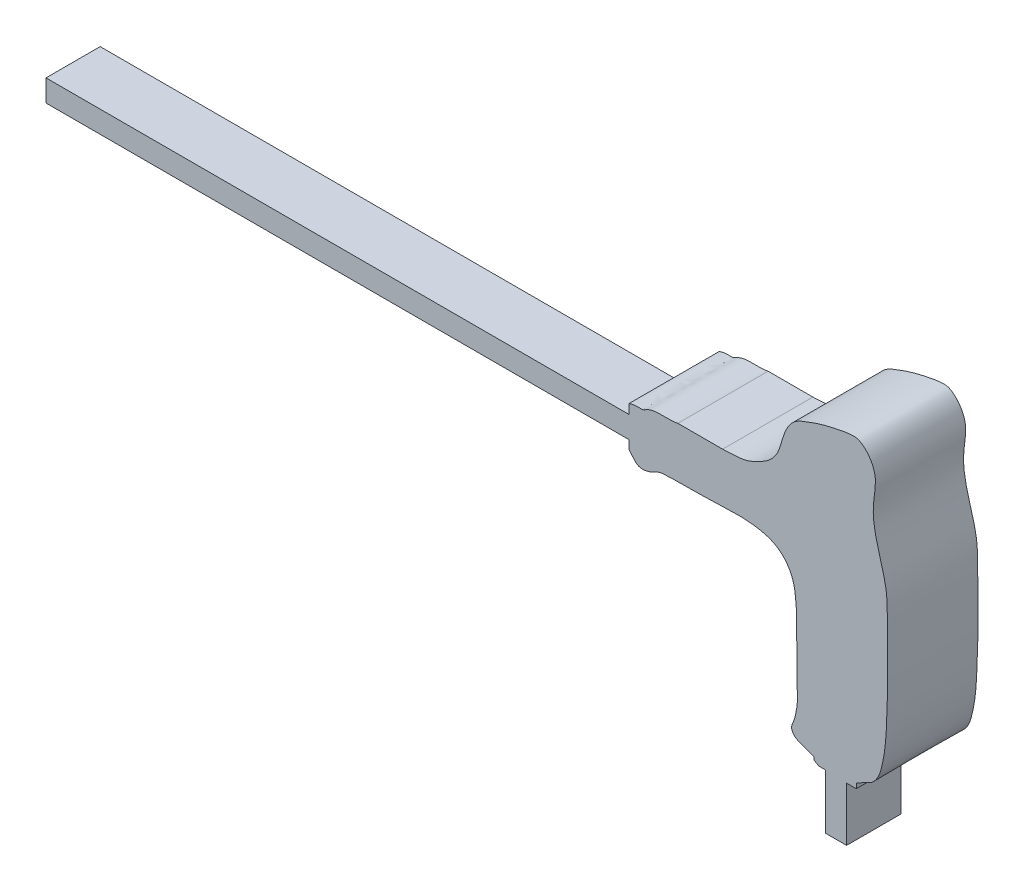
ISO-10303-21;
HEADER;
FILE_DESCRIPTION(('STEP AP214'),'2;1');
FILE_NAME('part.step','',(''),(''),'','','');
FILE_SCHEMA(('AUTOMOTIVE_DESIGN { 1 0 10303 214 1 1 1 1 }'));
ENDSEC;
DATA;
#1=APPLICATION_CONTEXT('core data for automotive mechanical design processes');
#2=APPLICATION_PROTOCOL_DEFINITION('international standard','automotive_design',2000,#1);
#3=PRODUCT_CONTEXT('',#1,'mechanical');
#4=PRODUCT('Part','Part','',(#3));
#5=PRODUCT_RELATED_PRODUCT_CATEGORY('part','',(#4));
#6=PRODUCT_DEFINITION_FORMATION('','',#4);
#7=PRODUCT_DEFINITION_CONTEXT('part definition',#1,'design');
#8=PRODUCT_DEFINITION('design','',#6,#7);
#9=PRODUCT_DEFINITION_SHAPE('','',#8);
#10=(LENGTH_UNIT() NAMED_UNIT(*) SI_UNIT(.MILLI.,.METRE.));
#11=(NAMED_UNIT(*) PLANE_ANGLE_UNIT() SI_UNIT($,.RADIAN.));
#12=(NAMED_UNIT(*) SI_UNIT($,.STERADIAN.) SOLID_ANGLE_UNIT());
#13=UNCERTAINTY_MEASURE_WITH_UNIT(LENGTH_MEASURE(1.E-05),#10,'distance_accuracy_value','');
#14=(GEOMETRIC_REPRESENTATION_CONTEXT(3) GLOBAL_UNCERTAINTY_ASSIGNED_CONTEXT((#13)) GLOBAL_UNIT_ASSIGNED_CONTEXT((#10,
#11,#12)) REPRESENTATION_CONTEXT('',''));
#15=CARTESIAN_POINT('',(0.,0.,0.));
#16=DIRECTION('',(0.,0.,1.));
#17=DIRECTION('',(1.,0.,0.));
#18=AXIS2_PLACEMENT_3D('',#15,#16,#17);
#19=CARTESIAN_POINT('',(248.543123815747,68.8810785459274,-10.));
#20=DIRECTION('',(1.,0.,0.));
#21=DIRECTION('',(0.,0.,-1.));
#22=AXIS2_PLACEMENT_3D('',#19,#20,#21);
#23=PLANE('',#22);
#24=DIRECTION('',(0.,0.,1.));
#25=VECTOR('',#24,1.);
#26=CARTESIAN_POINT('',(248.543123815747,68.8810785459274,-10.));
#27=LINE('',#26,#25);
#28=CARTESIAN_POINT('',(248.543123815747,68.8810785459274,-2.));
#29=VERTEX_POINT('',#28);
#30=CARTESIAN_POINT('',(248.543123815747,68.8810785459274,10.));
#31=VERTEX_POINT('',#30);
#32=EDGE_CURVE('E387',#29,#31,#27,.T.);
#33=ORIENTED_EDGE('',*,*,#32,.F.);
#34=DIRECTION('',(0.,-1.,0.));
#35=VECTOR('',#34,1.);
#36=CARTESIAN_POINT('',(248.543123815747,68.8810785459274,-2.));
#37=LINE('',#36,#35);
#38=CARTESIAN_POINT('',(248.543123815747,80.8323200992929,-2.));
#39=VERTEX_POINT('',#38);
#40=EDGE_CURVE('E183',#39,#29,#37,.T.);
#41=ORIENTED_EDGE('',*,*,#40,.F.);
#42=DIRECTION('',(0.,0.,1.));
#43=VECTOR('',#42,1.);
#44=CARTESIAN_POINT('',(248.543123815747,80.8323200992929,-10.));
#45=LINE('',#44,#43);
#46=CARTESIAN_POINT('',(248.543123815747,80.8323200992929,10.));
#47=VERTEX_POINT('',#46);
#48=EDGE_CURVE('E179',#39,#47,#45,.T.);
#49=ORIENTED_EDGE('',*,*,#48,.T.);
#50=DIRECTION('',(0.,1.,0.));
#51=VECTOR('',#50,1.);
#52=CARTESIAN_POINT('',(248.543123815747,68.8810785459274,10.));
#53=LINE('',#52,#51);
#54=EDGE_CURVE('E264',#31,#47,#53,.T.);
#55=ORIENTED_EDGE('',*,*,#54,.F.);
#56=EDGE_LOOP('',(#33,#41,#49,#55));
#57=FACE_BOUND('',#56,.T.);
#58=ADVANCED_FACE('F39',(#57),#23,.T.);
#59=CARTESIAN_POINT('',(243.892148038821,68.8810785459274,-10.));
#60=DIRECTION('',(0.,-1.,0.));
#61=DIRECTION('',(0.,0.,-1.));
#62=AXIS2_PLACEMENT_3D('',#59,#60,#61);
#63=PLANE('',#62);
#64=DIRECTION('',(0.,0.,1.));
#65=VECTOR('',#64,1.);
#66=CARTESIAN_POINT('',(243.892148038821,68.8810785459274,-10.));
#67=LINE('',#66,#65);
#68=CARTESIAN_POINT('',(243.892148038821,68.8810785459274,-2.));
#69=VERTEX_POINT('',#68);
#70=CARTESIAN_POINT('',(243.892148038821,68.8810785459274,10.));
#71=VERTEX_POINT('',#70);
#72=EDGE_CURVE('E384',#69,#71,#67,.T.);
#73=ORIENTED_EDGE('',*,*,#72,.F.);
#74=DIRECTION('',(-1.,0.,0.));
#75=VECTOR('',#74,1.);
#76=CARTESIAN_POINT('',(243.892148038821,68.8810785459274,-2.));
#77=LINE('',#76,#75);
#78=EDGE_CURVE('E189',#29,#69,#77,.T.);
#79=ORIENTED_EDGE('',*,*,#78,.F.);
#80=ORIENTED_EDGE('',*,*,#32,.T.);
#81=DIRECTION('',(1.,0.,0.));
#82=VECTOR('',#81,1.);
#83=CARTESIAN_POINT('',(243.892148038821,68.8810785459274,10.));
#84=LINE('',#83,#82);
#85=EDGE_CURVE('E260',#71,#31,#84,.T.);
#86=ORIENTED_EDGE('',*,*,#85,.F.);
#87=EDGE_LOOP('',(#73,#79,#80,#86));
#88=FACE_BOUND('',#87,.T.);
#89=ADVANCED_FACE('F341',(#88),#63,.T.);
#90=CARTESIAN_POINT('',(211.155897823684,131.182219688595,-10.));
#91=CARTESIAN_POINT('',(208.979704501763,130.678712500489,-10.));
#92=CARTESIAN_POINT('',(205.927795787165,131.591395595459,-10.));
#93=CARTESIAN_POINT('',(203.484426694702,129.856707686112,-10.));
#94=CARTESIAN_POINT('',(202.113381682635,129.945278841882,-10.));
#95=CARTESIAN_POINT('',(201.11870916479,129.844045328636,-10.));
#96=CARTESIAN_POINT('',(200.32685086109,129.565005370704,-10.));
#97=B_SPLINE_CURVE_WITH_KNOTS('',3,(#90,#91,#92,#93,#94,#95,#96),.UNSPECIFIED.,.F.,.F.,(4,1,1,1,
4),(0.,0.636596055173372,0.720634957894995,0.778990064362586,1.),.UNSPECIFIED.);
#98=DIRECTION('',(0.,0.,1.));
#99=VECTOR('',#98,1.);
#100=SURFACE_OF_LINEAR_EXTRUSION('',#97,#99);
#101=DIRECTION('',(0.,0.,1.));
#102=VECTOR('',#101,1.);
#103=CARTESIAN_POINT('',(200.32685086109,129.565005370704,-10.));
#104=LINE('',#103,#102);
#105=CARTESIAN_POINT('',(200.32685086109,129.565005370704,-10.));
#106=VERTEX_POINT('',#105);
#107=CARTESIAN_POINT('',(200.32685086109,129.565005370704,10.));
#108=VERTEX_POINT('',#107);
#109=EDGE_CURVE('E11',#106,#108,#104,.T.);
#110=ORIENTED_EDGE('',*,*,#109,.T.);
#111=CARTESIAN_POINT('',(211.155897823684,131.182219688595,10.));
#112=CARTESIAN_POINT('',(208.979704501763,130.678712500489,10.));
#113=CARTESIAN_POINT('',(205.927795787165,131.591395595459,10.));
#114=CARTESIAN_POINT('',(203.484426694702,129.856707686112,10.));
#115=CARTESIAN_POINT('',(202.113381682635,129.945278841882,10.));
#116=CARTESIAN_POINT('',(201.11870916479,129.844045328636,10.));
#117=CARTESIAN_POINT('',(200.32685086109,129.565005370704,10.));
#118=B_SPLINE_CURVE_WITH_KNOTS('',3,(#111,#112,#113,#114,#115,#116,#117),.UNSPECIFIED.,.F.,.F.,
(4,1,1,1,4),(0.,0.636596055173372,0.720634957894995,0.778990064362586,1.),.UNSPECIFIED.);
#119=CARTESIAN_POINT('',(211.155897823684,131.182219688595,10.));
#120=VERTEX_POINT('',#119);
#121=EDGE_CURVE('E293',#120,#108,#118,.T.);
#122=ORIENTED_EDGE('',*,*,#121,.F.);
#123=DIRECTION('',(0.,0.,1.));
#124=VECTOR('',#123,1.);
#125=CARTESIAN_POINT('',(211.155897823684,131.182219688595,-10.));
#126=LINE('',#125,#124);
#127=CARTESIAN_POINT('',(211.155897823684,131.182219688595,-10.));
#128=VERTEX_POINT('',#127);
#129=EDGE_CURVE('E49',#128,#120,#126,.T.);
#130=ORIENTED_EDGE('',*,*,#129,.F.);
#131=EDGE_CURVE('E410',#128,#106,#97,.T.);
#132=ORIENTED_EDGE('',*,*,#131,.T.);
#133=EDGE_LOOP('',(#110,#122,#130,#132));
#134=FACE_BOUND('',#133,.T.);
#135=ADVANCED_FACE('F347',(#134),#100,.T.);
#136=CARTESIAN_POINT('',(221.073684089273,131.182219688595,-10.));
#137=DIRECTION('',(0.,1.,0.));
#138=DIRECTION('',(0.,0.,1.));
#139=AXIS2_PLACEMENT_3D('',#136,#137,#138);
#140=PLANE('',#139);
#141=ORIENTED_EDGE('',*,*,#129,.T.);
#142=DIRECTION('',(-1.,0.,0.));
#143=VECTOR('',#142,1.);
#144=CARTESIAN_POINT('',(221.073684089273,131.182219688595,10.));
#145=LINE('',#144,#143);
#146=CARTESIAN_POINT('',(221.073684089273,131.182219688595,10.));
#147=VERTEX_POINT('',#146);
#148=EDGE_CURVE('E286',#147,#120,#145,.T.);
#149=ORIENTED_EDGE('',*,*,#148,.F.);
#150=DIRECTION('',(0.,0.,1.));
#151=VECTOR('',#150,1.);
#152=CARTESIAN_POINT('',(221.073684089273,131.182219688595,-10.));
#153=LINE('',#152,#151);
#154=CARTESIAN_POINT('',(221.073684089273,131.182219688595,-10.));
#155=VERTEX_POINT('',#154);
#156=EDGE_CURVE('E484',#155,#147,#153,.T.);
#157=ORIENTED_EDGE('',*,*,#156,.F.);
#158=DIRECTION('',(-1.,0.,0.));
#159=VECTOR('',#158,1.);
#160=CARTESIAN_POINT('',(221.073684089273,131.182219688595,-10.));
#161=LINE('',#160,#159);
#162=EDGE_CURVE('E414',#155,#128,#161,.T.);
#163=ORIENTED_EDGE('',*,*,#162,.T.);
#164=EDGE_LOOP('',(#141,#149,#157,#163));
#165=FACE_BOUND('',#164,.T.);
#166=ADVANCED_FACE('F434',(#165),#140,.T.);
#167=CARTESIAN_POINT('',(253.959450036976,83.6582294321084,-10.));
#168=CARTESIAN_POINT('',(255.413681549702,84.6922926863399,-10.));
#169=CARTESIAN_POINT('',(256.309889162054,87.3981421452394,-10.));
#170=CARTESIAN_POINT('',(257.160439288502,92.0414444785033,-10.));
#171=CARTESIAN_POINT('',(257.489936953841,97.8069514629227,-10.));
#172=CARTESIAN_POINT('',(257.740569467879,106.695670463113,-10.));
#173=CARTESIAN_POINT('',(257.629973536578,115.016264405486,-10.));
#174=CARTESIAN_POINT('',(257.507672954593,121.95001484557,-10.));
#175=CARTESIAN_POINT('',(256.412860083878,126.329435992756,-10.));
#176=CARTESIAN_POINT('',(255.268117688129,130.057147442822,-10.));
#177=CARTESIAN_POINT('',(254.587312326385,133.489662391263,-10.));
#178=CARTESIAN_POINT('',(254.291883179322,136.786594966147,-10.));
#179=CARTESIAN_POINT('',(254.855353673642,139.753661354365,-10.));
#180=CARTESIAN_POINT('',(254.96417065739,142.332617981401,-10.));
#181=CARTESIAN_POINT('',(254.602684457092,144.386360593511,-10.));
#182=CARTESIAN_POINT('',(253.368907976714,146.515906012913,-10.));
#183=CARTESIAN_POINT('',(251.312767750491,148.275219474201,-10.));
#184=CARTESIAN_POINT('',(249.073245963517,148.206115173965,-10.));
#185=CARTESIAN_POINT('',(246.675452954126,147.760865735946,-10.));
#186=CARTESIAN_POINT('',(243.29854346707,147.029921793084,-10.));
#187=CARTESIAN_POINT('',(239.860743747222,145.872385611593,-10.));
#188=CARTESIAN_POINT('',(236.767514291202,144.537003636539,-10.));
#189=CARTESIAN_POINT('',(235.06492199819,142.087752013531,-10.));
#190=CARTESIAN_POINT('',(234.190435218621,139.400971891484,-10.));
#191=CARTESIAN_POINT('',(233.410607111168,136.496224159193,-10.));
#192=CARTESIAN_POINT('',(231.543851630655,134.134279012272,-10.));
#193=CARTESIAN_POINT('',(229.032596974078,132.759340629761,-10.));
#194=CARTESIAN_POINT('',(225.671749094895,131.137093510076,-10.));
#195=CARTESIAN_POINT('',(222.852034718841,131.354890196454,-10.));
#196=CARTESIAN_POINT('',(221.073684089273,131.182219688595,-10.));
#197=B_SPLINE_CURVE_WITH_KNOTS('',3,(#167,#168,#169,#170,#171,#172,#173,#174,#175,#176,#177,
#178,#179,#180,#181,#182,#183,#184,#185,#186,#187,#188,#189,#190,#191,#192,#193,#194,#195,#196),
.UNSPECIFIED.,.F.,.F.,(4,1,1,1,1,1,1,1,1,1,1,1,1,1,1,1,1,1,1,1,1,1,1,1,1,1,1,4),(0.,
0.0484624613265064,0.0788890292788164,0.136163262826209,0.213713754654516,0.334449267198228,
0.375532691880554,0.412085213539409,0.463525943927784,0.487574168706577,0.512536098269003,
0.558031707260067,0.573645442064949,0.586449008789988,0.617324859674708,0.643355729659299,
0.658312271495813,0.67960839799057,0.713953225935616,0.756990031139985,0.784651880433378,
0.808074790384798,0.839786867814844,0.865879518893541,0.893817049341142,0.923166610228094,
0.947560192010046,1.),.UNSPECIFIED.);
#198=DIRECTION('',(0.,0.,1.));
#199=VECTOR('',#198,1.);
#200=SURFACE_OF_LINEAR_EXTRUSION('',#197,#199);
#201=ORIENTED_EDGE('',*,*,#156,.T.);
#202=CARTESIAN_POINT('',(253.959450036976,83.6582294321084,10.));
#203=CARTESIAN_POINT('',(255.413681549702,84.6922926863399,10.));
#204=CARTESIAN_POINT('',(256.309889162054,87.3981421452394,10.));
#205=CARTESIAN_POINT('',(257.160439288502,92.0414444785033,10.));
#206=CARTESIAN_POINT('',(257.489936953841,97.8069514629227,10.));
#207=CARTESIAN_POINT('',(257.740569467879,106.695670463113,10.));
#208=CARTESIAN_POINT('',(257.629973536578,115.016264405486,10.));
#209=CARTESIAN_POINT('',(257.507672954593,121.95001484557,10.));
#210=CARTESIAN_POINT('',(256.412860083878,126.329435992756,10.));
#211=CARTESIAN_POINT('',(255.268117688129,130.057147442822,10.));
#212=CARTESIAN_POINT('',(254.587312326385,133.489662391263,10.));
#213=CARTESIAN_POINT('',(254.291883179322,136.786594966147,10.));
#214=CARTESIAN_POINT('',(254.855353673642,139.753661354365,10.));
#215=CARTESIAN_POINT('',(254.96417065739,142.332617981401,10.));
#216=CARTESIAN_POINT('',(254.602684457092,144.386360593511,10.));
#217=CARTESIAN_POINT('',(253.368907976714,146.515906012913,10.));
#218=CARTESIAN_POINT('',(251.312767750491,148.275219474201,10.));
#219=CARTESIAN_POINT('',(249.073245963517,148.206115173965,10.));
#220=CARTESIAN_POINT('',(246.675452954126,147.760865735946,10.));
#221=CARTESIAN_POINT('',(243.29854346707,147.029921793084,10.));
#222=CARTESIAN_POINT('',(239.860743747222,145.872385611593,10.));
#223=CARTESIAN_POINT('',(236.767514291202,144.537003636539,10.));
#224=CARTESIAN_POINT('',(235.06492199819,142.087752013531,10.));
#225=CARTESIAN_POINT('',(234.190435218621,139.400971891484,10.));
#226=CARTESIAN_POINT('',(233.410607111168,136.496224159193,10.));
#227=CARTESIAN_POINT('',(231.543851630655,134.134279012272,10.));
#228=CARTESIAN_POINT('',(229.032596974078,132.759340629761,10.));
#229=CARTESIAN_POINT('',(225.671749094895,131.137093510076,10.));
#230=CARTESIAN_POINT('',(222.852034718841,131.354890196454,10.));
#231=CARTESIAN_POINT('',(221.073684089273,131.182219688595,10.));
#232=B_SPLINE_CURVE_WITH_KNOTS('',3,(#202,#203,#204,#205,#206,#207,#208,#209,#210,#211,#212,
#213,#214,#215,#216,#217,#218,#219,#220,#221,#222,#223,#224,#225,#226,#227,#228,#229,#230,#231),
.UNSPECIFIED.,.F.,.F.,(4,1,1,1,1,1,1,1,1,1,1,1,1,1,1,1,1,1,1,1,1,1,1,1,1,1,1,4),(0.,
0.0484624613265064,0.0788890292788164,0.136163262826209,0.213713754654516,0.334449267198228,
0.375532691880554,0.412085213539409,0.463525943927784,0.487574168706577,0.512536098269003,
0.558031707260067,0.573645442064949,0.586449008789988,0.617324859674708,0.643355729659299,
0.658312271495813,0.67960839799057,0.713953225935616,0.756990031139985,0.784651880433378,
0.808074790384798,0.839786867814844,0.865879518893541,0.893817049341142,0.923166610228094,
0.947560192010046,1.),.UNSPECIFIED.);
#233=CARTESIAN_POINT('',(253.959450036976,83.6582294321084,10.));
#234=VERTEX_POINT('',#233);
#235=EDGE_CURVE('E280',#234,#147,#232,.T.);
#236=ORIENTED_EDGE('',*,*,#235,.F.);
#237=DIRECTION('',(0.,0.,1.));
#238=VECTOR('',#237,1.);
#239=CARTESIAN_POINT('',(253.959450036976,83.6582294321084,-10.));
#240=LINE('',#239,#238);
#241=CARTESIAN_POINT('',(253.959450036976,83.6582294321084,-10.));
#242=VERTEX_POINT('',#241);
#243=EDGE_CURVE('E489',#242,#234,#240,.T.);
#244=ORIENTED_EDGE('',*,*,#243,.F.);
#245=EDGE_CURVE('E420',#242,#155,#197,.T.);
#246=ORIENTED_EDGE('',*,*,#245,.T.);
#247=EDGE_LOOP('',(#201,#236,#244,#246));
#248=FACE_BOUND('',#247,.T.);
#249=ADVANCED_FACE('F438',(#248),#200,.T.);
#250=CARTESIAN_POINT('',(250.691992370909,81.9541921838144,-10.));
#251=DIRECTION('',(0.462411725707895,-0.886665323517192,0.));
#252=DIRECTION('',(0.886665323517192,0.462411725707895,0.));
#253=AXIS2_PLACEMENT_3D('',#250,#251,#252);
#254=PLANE('',#253);
#255=ORIENTED_EDGE('',*,*,#243,.T.);
#256=DIRECTION('',(0.886665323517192,0.462411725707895,0.));
#257=VECTOR('',#256,1.);
#258=CARTESIAN_POINT('',(250.691992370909,81.9541921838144,10.));
#259=LINE('',#258,#257);
#260=CARTESIAN_POINT('',(250.691992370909,81.9541921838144,10.));
#261=VERTEX_POINT('',#260);
#262=EDGE_CURVE('E276',#261,#234,#259,.T.);
#263=ORIENTED_EDGE('',*,*,#262,.F.);
#264=DIRECTION('',(0.,0.,1.));
#265=VECTOR('',#264,1.);
#266=CARTESIAN_POINT('',(250.691992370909,81.9541921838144,-10.));
#267=LINE('',#266,#265);
#268=CARTESIAN_POINT('',(250.691992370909,81.9541921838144,-10.));
#269=VERTEX_POINT('',#268);
#270=EDGE_CURVE('E493',#269,#261,#267,.T.);
#271=ORIENTED_EDGE('',*,*,#270,.F.);
#272=DIRECTION('',(0.886665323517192,0.462411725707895,0.));
#273=VECTOR('',#272,1.);
#274=CARTESIAN_POINT('',(250.691992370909,81.9541921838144,-10.));
#275=LINE('',#274,#273);
#276=EDGE_CURVE('E450',#269,#242,#275,.T.);
#277=ORIENTED_EDGE('',*,*,#276,.T.);
#278=EDGE_LOOP('',(#255,#263,#271,#277));
#279=FACE_BOUND('',#278,.T.);
#280=ADVANCED_FACE('F442',(#279),#254,.T.);
#281=CARTESIAN_POINT('',(250.691992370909,80.8323200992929,-10.));
#282=DIRECTION('',(1.,0.,0.));
#283=DIRECTION('',(0.,0.,-1.));
#284=AXIS2_PLACEMENT_3D('',#281,#282,#283);
#285=PLANE('',#284);
#286=ORIENTED_EDGE('',*,*,#270,.T.);
#287=DIRECTION('',(0.,1.,0.));
#288=VECTOR('',#287,1.);
#289=CARTESIAN_POINT('',(250.691992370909,80.8323200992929,10.));
#290=LINE('',#289,#288);
#291=CARTESIAN_POINT('',(250.691992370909,80.8323200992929,10.));
#292=VERTEX_POINT('',#291);
#293=EDGE_CURVE('E272',#292,#261,#290,.T.);
#294=ORIENTED_EDGE('',*,*,#293,.F.);
#295=DIRECTION('',(0.,0.,1.));
#296=VECTOR('',#295,1.);
#297=CARTESIAN_POINT('',(250.691992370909,80.8323200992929,-10.));
#298=LINE('',#297,#296);
#299=CARTESIAN_POINT('',(250.691992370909,80.8323200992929,-10.));
#300=VERTEX_POINT('',#299);
#301=EDGE_CURVE('E498',#300,#292,#298,.T.);
#302=ORIENTED_EDGE('',*,*,#301,.F.);
#303=DIRECTION('',(0.,1.,0.));
#304=VECTOR('',#303,1.);
#305=CARTESIAN_POINT('',(250.691992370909,80.8323200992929,-10.));
#306=LINE('',#305,#304);
#307=EDGE_CURVE('E457',#300,#269,#306,.T.);
#308=ORIENTED_EDGE('',*,*,#307,.T.);
#309=EDGE_LOOP('',(#286,#294,#302,#308));
#310=FACE_BOUND('',#309,.T.);
#311=ADVANCED_FACE('F510',(#310),#285,.T.);
#312=CARTESIAN_POINT('',(248.543123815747,80.8323200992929,-10.));
#313=DIRECTION('',(0.,-1.,0.));
#314=DIRECTION('',(0.,0.,-1.));
#315=AXIS2_PLACEMENT_3D('',#312,#313,#314);
#316=PLANE('',#315);
#317=ORIENTED_EDGE('',*,*,#301,.T.);
#318=DIRECTION('',(1.,0.,0.));
#319=VECTOR('',#318,1.);
#320=CARTESIAN_POINT('',(248.543123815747,80.8323200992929,10.));
#321=LINE('',#320,#319);
#322=EDGE_CURVE('E268',#47,#292,#321,.T.);
#323=ORIENTED_EDGE('',*,*,#322,.F.);
#324=ORIENTED_EDGE('',*,*,#48,.F.);
#325=DIRECTION('',(1.,0.,0.));
#326=VECTOR('',#325,1.);
#327=CARTESIAN_POINT('',(243.892148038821,80.8323200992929,-2.));
#328=LINE('',#327,#326);
#329=CARTESIAN_POINT('',(243.892148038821,80.8323200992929,-2.));
#330=VERTEX_POINT('',#329);
#331=EDGE_CURVE('E172',#330,#39,#328,.T.);
#332=ORIENTED_EDGE('',*,*,#331,.F.);
#333=DIRECTION('',(0.,0.,-1.));
#334=VECTOR('',#333,1.);
#335=CARTESIAN_POINT('',(243.892148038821,80.8323200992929,-2.));
#336=LINE('',#335,#334);
#337=CARTESIAN_POINT('',(243.892148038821,80.8323200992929,-10.));
#338=VERTEX_POINT('',#337);
#339=EDGE_CURVE('E176',#330,#338,#336,.T.);
#340=ORIENTED_EDGE('',*,*,#339,.T.);
#341=DIRECTION('',(1.,0.,0.));
#342=VECTOR('',#341,1.);
#343=CARTESIAN_POINT('',(248.543123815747,80.8323200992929,-10.));
#344=LINE('',#343,#342);
#345=EDGE_CURVE('E57',#338,#300,#344,.T.);
#346=ORIENTED_EDGE('',*,*,#345,.T.);
#347=EDGE_LOOP('',(#317,#323,#324,#332,#340,#346));
#348=FACE_BOUND('',#347,.T.);
#349=ADVANCED_FACE('F174',(#348),#316,.T.);
#350=CARTESIAN_POINT('',(243.892148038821,81.0236115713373,-10.));
#351=DIRECTION('',(-1.,0.,0.));
#352=DIRECTION('',(0.,0.,1.));
#353=AXIS2_PLACEMENT_3D('',#350,#351,#352);
#354=PLANE('',#353);
#355=ORIENTED_EDGE('',*,*,#339,.F.);
#356=DIRECTION('',(0.,1.,0.));
#357=VECTOR('',#356,1.);
#358=CARTESIAN_POINT('',(243.892148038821,68.8810785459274,-2.));
#359=LINE('',#358,#357);
#360=EDGE_CURVE('E184',#69,#330,#359,.T.);
#361=ORIENTED_EDGE('',*,*,#360,.F.);
#362=ORIENTED_EDGE('',*,*,#72,.T.);
#363=DIRECTION('',(0.,-1.,0.));
#364=VECTOR('',#363,1.);
#365=CARTESIAN_POINT('',(243.892148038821,81.0236115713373,10.));
#366=LINE('',#365,#364);
#367=CARTESIAN_POINT('',(243.892148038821,81.0236115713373,10.));
#368=VERTEX_POINT('',#367);
#369=EDGE_CURVE('E256',#368,#71,#366,.T.);
#370=ORIENTED_EDGE('',*,*,#369,.F.);
#371=DIRECTION('',(0.,0.,1.));
#372=VECTOR('',#371,1.);
#373=CARTESIAN_POINT('',(243.892148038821,81.0236115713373,-10.));
#374=LINE('',#373,#372);
#375=CARTESIAN_POINT('',(243.892148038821,81.0236115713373,-10.));
#376=VERTEX_POINT('',#375);
#377=EDGE_CURVE('E375',#376,#368,#374,.T.);
#378=ORIENTED_EDGE('',*,*,#377,.F.);
#379=DIRECTION('',(0.,-1.,0.));
#380=VECTOR('',#379,1.);
#381=CARTESIAN_POINT('',(243.892148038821,81.0236115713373,-10.));
#382=LINE('',#381,#380);
#383=EDGE_CURVE('E196',#376,#338,#382,.T.);
#384=ORIENTED_EDGE('',*,*,#383,.T.);
#385=EDGE_LOOP('',(#355,#361,#362,#370,#378,#384));
#386=FACE_BOUND('',#385,.T.);
#387=ADVANCED_FACE('F195',(#386),#354,.T.);
#388=CARTESIAN_POINT('',(242.392308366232,81.0236115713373,-10.));
#389=DIRECTION('',(0.,-1.,0.));
#390=DIRECTION('',(0.,0.,-1.));
#391=AXIS2_PLACEMENT_3D('',#388,#389,#390);
#392=PLANE('',#391);
#393=ORIENTED_EDGE('',*,*,#377,.T.);
#394=DIRECTION('',(1.,0.,0.));
#395=VECTOR('',#394,1.);
#396=CARTESIAN_POINT('',(242.392308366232,81.0236115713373,10.));
#397=LINE('',#396,#395);
#398=CARTESIAN_POINT('',(242.392308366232,81.0236115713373,10.));
#399=VERTEX_POINT('',#398);
#400=EDGE_CURVE('E252',#399,#368,#397,.T.);
#401=ORIENTED_EDGE('',*,*,#400,.F.);
#402=DIRECTION('',(0.,0.,1.));
#403=VECTOR('',#402,1.);
#404=CARTESIAN_POINT('',(242.392308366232,81.0236115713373,-10.));
#405=LINE('',#404,#403);
#406=CARTESIAN_POINT('',(242.392308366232,81.0236115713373,-10.));
#407=VERTEX_POINT('',#406);
#408=EDGE_CURVE('E368',#407,#399,#405,.T.);
#409=ORIENTED_EDGE('',*,*,#408,.F.);
#410=DIRECTION('',(1.,0.,0.));
#411=VECTOR('',#410,1.);
#412=CARTESIAN_POINT('',(242.392308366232,81.0236115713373,-10.));
#413=LINE('',#412,#411);
#414=EDGE_CURVE('E382',#407,#376,#413,.T.);
#415=ORIENTED_EDGE('',*,*,#414,.T.);
#416=EDGE_LOOP('',(#393,#401,#409,#415));
#417=FACE_BOUND('',#416,.T.);
#418=ADVANCED_FACE('F356',(#417),#392,.T.);
#419=CARTESIAN_POINT('',(241.362331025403,81.5976705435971,-10.));
#420=DIRECTION('',(-0.486840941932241,-0.873490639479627,0.));
#421=DIRECTION('',(0.873490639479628,-0.486840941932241,0.));
#422=AXIS2_PLACEMENT_3D('',#419,#420,#421);
#423=PLANE('',#422);
#424=ORIENTED_EDGE('',*,*,#408,.T.);
#425=DIRECTION('',(0.873490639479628,-0.486840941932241,0.));
#426=VECTOR('',#425,1.);
#427=CARTESIAN_POINT('',(241.362331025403,81.5976705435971,10.));
#428=LINE('',#427,#426);
#429=CARTESIAN_POINT('',(241.362331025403,81.5976705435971,10.));
#430=VERTEX_POINT('',#429);
#431=EDGE_CURVE('E248',#430,#399,#428,.T.);
#432=ORIENTED_EDGE('',*,*,#431,.F.);
#433=DIRECTION('',(0.,0.,1.));
#434=VECTOR('',#433,1.);
#435=CARTESIAN_POINT('',(241.362331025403,81.5976705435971,-10.));
#436=LINE('',#435,#434);
#437=CARTESIAN_POINT('',(241.362331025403,81.5976705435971,-10.));
#438=VERTEX_POINT('',#437);
#439=EDGE_CURVE('E376',#438,#430,#436,.T.);
#440=ORIENTED_EDGE('',*,*,#439,.F.);
#441=DIRECTION('',(0.873490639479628,-0.486840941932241,0.));
#442=VECTOR('',#441,1.);
#443=CARTESIAN_POINT('',(241.362331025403,81.5976705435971,-10.));
#444=LINE('',#443,#442);
#445=EDGE_CURVE('E370',#438,#407,#444,.T.);
#446=ORIENTED_EDGE('',*,*,#445,.T.);
#447=EDGE_LOOP('',(#424,#432,#440,#446));
#448=FACE_BOUND('',#447,.T.);
#449=ADVANCED_FACE('F358',(#448),#423,.T.);
#450=CARTESIAN_POINT('',(241.362331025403,82.3107138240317,-10.));
#451=DIRECTION('',(-1.,0.,0.));
#452=DIRECTION('',(0.,0.,1.));
#453=AXIS2_PLACEMENT_3D('',#450,#451,#452);
#454=PLANE('',#453);
#455=ORIENTED_EDGE('',*,*,#439,.T.);
#456=DIRECTION('',(0.,-1.,0.));
#457=VECTOR('',#456,1.);
#458=CARTESIAN_POINT('',(241.362331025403,82.3107138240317,10.));
#459=LINE('',#458,#457);
#460=CARTESIAN_POINT('',(241.362331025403,82.3107138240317,10.));
#461=VERTEX_POINT('',#460);
#462=EDGE_CURVE('E241',#461,#430,#459,.T.);
#463=ORIENTED_EDGE('',*,*,#462,.F.);
#464=DIRECTION('',(0.,0.,1.));
#465=VECTOR('',#464,1.);
#466=CARTESIAN_POINT('',(241.362331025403,82.3107138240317,-10.));
#467=LINE('',#466,#465);
#468=CARTESIAN_POINT('',(241.362331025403,82.3107138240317,-10.));
#469=VERTEX_POINT('',#468);
#470=EDGE_CURVE('E393',#469,#461,#467,.T.);
#471=ORIENTED_EDGE('',*,*,#470,.F.);
#472=DIRECTION('',(0.,-1.,0.));
#473=VECTOR('',#472,1.);
#474=CARTESIAN_POINT('',(241.362331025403,82.3107138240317,-10.));
#475=LINE('',#474,#473);
#476=EDGE_CURVE('E312',#469,#438,#475,.T.);
#477=ORIENTED_EDGE('',*,*,#476,.T.);
#478=EDGE_LOOP('',(#455,#463,#471,#477));
#479=FACE_BOUND('',#478,.T.);
#480=ADVANCED_FACE('F323',(#479),#454,.T.);
#481=CARTESIAN_POINT('',(200.32685086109,120.780955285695,-10.));
#482=CARTESIAN_POINT('',(200.976403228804,120.118576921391,-10.));
#483=CARTESIAN_POINT('',(201.790471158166,118.498355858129,-10.));
#484=CARTESIAN_POINT('',(203.571592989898,118.445839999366,-10.));
#485=CARTESIAN_POINT('',(204.776091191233,118.654219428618,-10.));
#486=CARTESIAN_POINT('',(205.922609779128,119.212294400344,-10.));
#487=CARTESIAN_POINT('',(207.44815295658,119.971812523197,-10.));
#488=CARTESIAN_POINT('',(208.767127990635,119.848146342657,-10.));
#489=CARTESIAN_POINT('',(209.962572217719,119.964572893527,-10.));
#490=CARTESIAN_POINT('',(211.057221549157,119.954960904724,-10.));
#491=CARTESIAN_POINT('',(213.076805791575,119.993248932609,-10.));
#492=CARTESIAN_POINT('',(215.827043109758,119.999505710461,-10.));
#493=CARTESIAN_POINT('',(218.90325790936,120.085876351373,-10.));
#494=CARTESIAN_POINT('',(221.801662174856,120.185317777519,-10.));
#495=CARTESIAN_POINT('',(224.392229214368,120.321512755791,-10.));
#496=CARTESIAN_POINT('',(226.841122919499,120.172470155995,-10.));
#497=CARTESIAN_POINT('',(229.371234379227,119.900831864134,-10.));
#498=CARTESIAN_POINT('',(231.753046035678,119.250177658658,-10.));
#499=CARTESIAN_POINT('',(234.550302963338,117.638497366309,-10.));
#500=CARTESIAN_POINT('',(236.53838661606,114.838754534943,-10.));
#501=CARTESIAN_POINT('',(237.427403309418,110.493285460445,-10.));
#502=CARTESIAN_POINT('',(237.477582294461,105.640384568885,-10.));
#503=CARTESIAN_POINT('',(237.490623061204,99.9514844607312,-10.));
#504=CARTESIAN_POINT('',(237.541604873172,94.875564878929,-10.));
#505=CARTESIAN_POINT('',(237.752640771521,91.1238899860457,-10.));
#506=CARTESIAN_POINT('',(237.332269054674,88.6961237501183,-10.));
#507=CARTESIAN_POINT('',(236.97303681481,87.1397857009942,-10.));
#508=CARTESIAN_POINT('',(236.375375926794,85.9999351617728,-10.));
#509=CARTESIAN_POINT('',(236.316166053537,85.0276397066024,-10.));
#510=CARTESIAN_POINT('',(237.006319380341,83.9041648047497,-10.));
#511=CARTESIAN_POINT('',(238.872882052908,83.0938640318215,-10.));
#512=CARTESIAN_POINT('',(240.433411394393,82.6443752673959,-10.));
#513=CARTESIAN_POINT('',(241.362331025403,82.3107138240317,-10.));
#514=B_SPLINE_CURVE_WITH_KNOTS('',3,(#481,#482,#483,#484,#485,#486,#487,#488,#489,#490,#491,
#492,#493,#494,#495,#496,#497,#498,#499,#500,#501,#502,#503,#504,#505,#506,#507,#508,#509,#510,
#511,#512,#513),.UNSPECIFIED.,.F.,.F.,(4,1,1,1,1,1,1,1,1,1,1,1,1,1,1,1,1,1,1,1,1,1,1,1,1,1,1,1,
1,1,4),(0.,0.0417190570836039,0.0569951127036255,0.0677574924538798,0.0907017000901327,
0.10765282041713,0.134914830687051,0.141748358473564,0.15579828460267,0.178637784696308,
0.222641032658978,0.265843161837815,0.301798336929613,0.338741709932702,0.369558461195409,
0.399857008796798,0.440590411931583,0.467229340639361,0.527997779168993,0.570154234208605,
0.643488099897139,0.721730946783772,0.797897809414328,0.84701082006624,0.871143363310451,
0.89637921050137,0.910442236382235,0.922365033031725,0.933353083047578,0.960883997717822,1.),.UNSPECIFIED.);
#515=DIRECTION('',(0.,0.,1.));
#516=VECTOR('',#515,1.);
#517=SURFACE_OF_LINEAR_EXTRUSION('',#514,#516);
#518=ORIENTED_EDGE('',*,*,#470,.T.);
#519=CARTESIAN_POINT('',(200.32685086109,120.780955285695,10.));
#520=CARTESIAN_POINT('',(200.976403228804,120.118576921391,10.));
#521=CARTESIAN_POINT('',(201.790471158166,118.498355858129,10.));
#522=CARTESIAN_POINT('',(203.571592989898,118.445839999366,10.));
#523=CARTESIAN_POINT('',(204.776091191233,118.654219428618,10.));
#524=CARTESIAN_POINT('',(205.922609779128,119.212294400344,10.));
#525=CARTESIAN_POINT('',(207.44815295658,119.971812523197,10.));
#526=CARTESIAN_POINT('',(208.767127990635,119.848146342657,10.));
#527=CARTESIAN_POINT('',(209.962572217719,119.964572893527,10.));
#528=CARTESIAN_POINT('',(211.057221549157,119.954960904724,10.));
#529=CARTESIAN_POINT('',(213.076805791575,119.993248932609,10.));
#530=CARTESIAN_POINT('',(215.827043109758,119.999505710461,10.));
#531=CARTESIAN_POINT('',(218.90325790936,120.085876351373,10.));
#532=CARTESIAN_POINT('',(221.801662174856,120.185317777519,10.));
#533=CARTESIAN_POINT('',(224.392229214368,120.321512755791,10.));
#534=CARTESIAN_POINT('',(226.841122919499,120.172470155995,10.));
#535=CARTESIAN_POINT('',(229.371234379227,119.900831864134,10.));
#536=CARTESIAN_POINT('',(231.753046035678,119.250177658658,10.));
#537=CARTESIAN_POINT('',(234.550302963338,117.638497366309,10.));
#538=CARTESIAN_POINT('',(236.53838661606,114.838754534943,10.));
#539=CARTESIAN_POINT('',(237.427403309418,110.493285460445,10.));
#540=CARTESIAN_POINT('',(237.477582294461,105.640384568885,10.));
#541=CARTESIAN_POINT('',(237.490623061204,99.9514844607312,10.));
#542=CARTESIAN_POINT('',(237.541604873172,94.875564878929,10.));
#543=CARTESIAN_POINT('',(237.752640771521,91.1238899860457,10.));
#544=CARTESIAN_POINT('',(237.332269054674,88.6961237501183,10.));
#545=CARTESIAN_POINT('',(236.97303681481,87.1397857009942,10.));
#546=CARTESIAN_POINT('',(236.375375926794,85.9999351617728,10.));
#547=CARTESIAN_POINT('',(236.316166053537,85.0276397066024,10.));
#548=CARTESIAN_POINT('',(237.006319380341,83.9041648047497,10.));
#549=CARTESIAN_POINT('',(238.872882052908,83.0938640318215,10.));
#550=CARTESIAN_POINT('',(240.433411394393,82.6443752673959,10.));
#551=CARTESIAN_POINT('',(241.362331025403,82.3107138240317,10.));
#552=B_SPLINE_CURVE_WITH_KNOTS('',3,(#519,#520,#521,#522,#523,#524,#525,#526,#527,#528,#529,
#530,#531,#532,#533,#534,#535,#536,#537,#538,#539,#540,#541,#542,#543,#544,#545,#546,#547,#548,
#549,#550,#551),.UNSPECIFIED.,.F.,.F.,(4,1,1,1,1,1,1,1,1,1,1,1,1,1,1,1,1,1,1,1,1,1,1,1,1,1,1,1,
1,1,4),(0.,0.0417190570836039,0.0569951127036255,0.0677574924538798,0.0907017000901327,
0.10765282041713,0.134914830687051,0.141748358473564,0.15579828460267,0.178637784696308,
0.222641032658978,0.265843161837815,0.301798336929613,0.338741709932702,0.369558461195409,
0.399857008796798,0.440590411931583,0.467229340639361,0.527997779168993,0.570154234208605,
0.643488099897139,0.721730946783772,0.797897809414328,0.84701082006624,0.871143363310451,
0.89637921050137,0.910442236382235,0.922365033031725,0.933353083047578,0.960883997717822,1.),.UNSPECIFIED.);
#553=CARTESIAN_POINT('',(200.32685086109,120.780955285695,10.));
#554=VERTEX_POINT('',#553);
#555=EDGE_CURVE('E235',#554,#461,#552,.T.);
#556=ORIENTED_EDGE('',*,*,#555,.F.);
#557=DIRECTION('',(0.,0.,1.));
#558=VECTOR('',#557,1.);
#559=CARTESIAN_POINT('',(200.32685086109,120.780955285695,-10.));
#560=LINE('',#559,#558);
#561=CARTESIAN_POINT('',(200.32685086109,120.780955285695,-10.));
#562=VERTEX_POINT('',#561);
#563=EDGE_CURVE('E396',#562,#554,#560,.T.);
#564=ORIENTED_EDGE('',*,*,#563,.F.);
#565=EDGE_CURVE('E305',#562,#469,#514,.T.);
#566=ORIENTED_EDGE('',*,*,#565,.T.);
#567=EDGE_LOOP('',(#518,#556,#564,#566));
#568=FACE_BOUND('',#567,.T.);
#569=ADVANCED_FACE('F318',(#568),#517,.T.);
#570=CARTESIAN_POINT('',(200.32685086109,122.63118732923,-10.));
#571=DIRECTION('',(-1.,0.,0.));
#572=DIRECTION('',(0.,0.,1.));
#573=AXIS2_PLACEMENT_3D('',#570,#571,#572);
#574=PLANE('',#573);
#575=ORIENTED_EDGE('',*,*,#563,.T.);
#576=DIRECTION('',(0.,-1.,0.));
#577=VECTOR('',#576,1.);
#578=CARTESIAN_POINT('',(200.32685086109,122.63118732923,10.));
#579=LINE('',#578,#577);
#580=CARTESIAN_POINT('',(200.32685086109,122.63118732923,10.));
#581=VERTEX_POINT('',#580);
#582=EDGE_CURVE('E231',#581,#554,#579,.T.);
#583=ORIENTED_EDGE('',*,*,#582,.F.);
#584=DIRECTION('',(0.,0.,1.));
#585=VECTOR('',#584,1.);
#586=CARTESIAN_POINT('',(200.32685086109,122.63118732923,-10.));
#587=LINE('',#586,#585);
#588=CARTESIAN_POINT('',(200.32685086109,122.63118732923,-2.));
#589=VERTEX_POINT('',#588);
#590=EDGE_CURVE('E399',#589,#581,#587,.T.);
#591=ORIENTED_EDGE('',*,*,#590,.F.);
#592=DIRECTION('',(0.,-1.,0.));
#593=VECTOR('',#592,1.);
#594=CARTESIAN_POINT('',(200.32685086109,127.469215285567,-2.));
#595=LINE('',#594,#593);
#596=CARTESIAN_POINT('',(200.32685086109,127.469215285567,-2.));
#597=VERTEX_POINT('',#596);
#598=EDGE_CURVE('E215',#597,#589,#595,.T.);
#599=ORIENTED_EDGE('',*,*,#598,.F.);
#600=DIRECTION('',(0.,0.,1.));
#601=VECTOR('',#600,1.);
#602=CARTESIAN_POINT('',(200.32685086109,127.469215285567,-10.));
#603=LINE('',#602,#601);
#604=CARTESIAN_POINT('',(200.32685086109,127.469215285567,10.));
#605=VERTEX_POINT('',#604);
#606=EDGE_CURVE('E43',#597,#605,#603,.T.);
#607=ORIENTED_EDGE('',*,*,#606,.T.);
#608=DIRECTION('',(0.,-1.,0.));
#609=VECTOR('',#608,1.);
#610=CARTESIAN_POINT('',(200.32685086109,129.565005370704,10.));
#611=LINE('',#610,#609);
#612=EDGE_CURVE('E198',#108,#605,#611,.T.);
#613=ORIENTED_EDGE('',*,*,#612,.F.);
#614=ORIENTED_EDGE('',*,*,#109,.F.);
#615=DIRECTION('',(0.,-1.,0.));
#616=VECTOR('',#615,1.);
#617=CARTESIAN_POINT('',(200.32685086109,129.565005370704,-10.));
#618=LINE('',#617,#616);
#619=EDGE_CURVE('E299',#106,#562,#618,.T.);
#620=ORIENTED_EDGE('',*,*,#619,.T.);
#621=EDGE_LOOP('',(#575,#583,#591,#599,#607,#613,#614,#620));
#622=FACE_BOUND('',#621,.T.);
#623=ADVANCED_FACE('F322',(#622),#574,.T.);
#624=CARTESIAN_POINT('',(71.1469511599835,122.63118732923,-10.));
#625=DIRECTION('',(0.,-1.,0.));
#626=DIRECTION('',(0.,0.,-1.));
#627=AXIS2_PLACEMENT_3D('',#624,#625,#626);
#628=PLANE('',#627);
#629=DIRECTION('',(-1.,0.,0.));
#630=VECTOR('',#629,1.);
#631=CARTESIAN_POINT('',(71.1469511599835,122.63118732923,-2.));
#632=LINE('',#631,#630);
#633=CARTESIAN_POINT('',(71.1469511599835,122.63118732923,-2.));
#634=VERTEX_POINT('',#633);
#635=EDGE_CURVE('E193',#589,#634,#632,.T.);
#636=ORIENTED_EDGE('',*,*,#635,.F.);
#637=ORIENTED_EDGE('',*,*,#590,.T.);
#638=DIRECTION('',(1.,0.,0.));
#639=VECTOR('',#638,1.);
#640=CARTESIAN_POINT('',(71.1469511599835,122.63118732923,10.));
#641=LINE('',#640,#639);
#642=CARTESIAN_POINT('',(71.1469511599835,122.63118732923,10.));
#643=VERTEX_POINT('',#642);
#644=EDGE_CURVE('E227',#643,#581,#641,.T.);
#645=ORIENTED_EDGE('',*,*,#644,.F.);
#646=DIRECTION('',(0.,0.,1.));
#647=VECTOR('',#646,1.);
#648=CARTESIAN_POINT('',(71.1469511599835,122.63118732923,-10.));
#649=LINE('',#648,#647);
#650=EDGE_CURVE('E402',#634,#643,#649,.T.);
#651=ORIENTED_EDGE('',*,*,#650,.F.);
#652=EDGE_LOOP('',(#636,#637,#645,#651));
#653=FACE_BOUND('',#652,.T.);
#654=ADVANCED_FACE('F328',(#653),#628,.T.);
#655=CARTESIAN_POINT('',(71.1469511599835,127.469215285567,-10.));
#656=DIRECTION('',(-1.,0.,0.));
#657=DIRECTION('',(0.,0.,1.));
#658=AXIS2_PLACEMENT_3D('',#655,#656,#657);
#659=PLANE('',#658);
#660=DIRECTION('',(0.,1.,0.));
#661=VECTOR('',#660,1.);
#662=CARTESIAN_POINT('',(71.1469511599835,127.469215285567,-2.));
#663=LINE('',#662,#661);
#664=CARTESIAN_POINT('',(71.1469511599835,127.469215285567,-2.));
#665=VERTEX_POINT('',#664);
#666=EDGE_CURVE('E208',#634,#665,#663,.T.);
#667=ORIENTED_EDGE('',*,*,#666,.F.);
#668=ORIENTED_EDGE('',*,*,#650,.T.);
#669=DIRECTION('',(0.,-1.,0.));
#670=VECTOR('',#669,1.);
#671=CARTESIAN_POINT('',(71.1469511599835,127.469215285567,10.));
#672=LINE('',#671,#670);
#673=CARTESIAN_POINT('',(71.1469511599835,127.469215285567,10.));
#674=VERTEX_POINT('',#673);
#675=EDGE_CURVE('E223',#674,#643,#672,.T.);
#676=ORIENTED_EDGE('',*,*,#675,.F.);
#677=DIRECTION('',(0.,0.,1.));
#678=VECTOR('',#677,1.);
#679=CARTESIAN_POINT('',(71.1469511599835,127.469215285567,-10.));
#680=LINE('',#679,#678);
#681=EDGE_CURVE('E404',#665,#674,#680,.T.);
#682=ORIENTED_EDGE('',*,*,#681,.F.);
#683=EDGE_LOOP('',(#667,#668,#676,#682));
#684=FACE_BOUND('',#683,.T.);
#685=ADVANCED_FACE('F330',(#684),#659,.T.);
#686=CARTESIAN_POINT('',(200.32685086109,127.469215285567,-10.));
#687=DIRECTION('',(0.,1.,0.));
#688=DIRECTION('',(-1.,0.,0.));
#689=AXIS2_PLACEMENT_3D('',#686,#687,#688);
#690=PLANE('',#689);
#691=DIRECTION('',(1.,0.,0.));
#692=VECTOR('',#691,1.);
#693=CARTESIAN_POINT('',(71.1469511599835,127.469215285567,-2.));
#694=LINE('',#693,#692);
#695=EDGE_CURVE('E211',#665,#597,#694,.T.);
#696=ORIENTED_EDGE('',*,*,#695,.F.);
#697=ORIENTED_EDGE('',*,*,#681,.T.);
#698=DIRECTION('',(-1.,0.,0.));
#699=VECTOR('',#698,1.);
#700=CARTESIAN_POINT('',(200.32685086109,127.469215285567,10.));
#701=LINE('',#700,#699);
#702=EDGE_CURVE('E203',#605,#674,#701,.T.);
#703=ORIENTED_EDGE('',*,*,#702,.F.);
#704=ORIENTED_EDGE('',*,*,#606,.F.);
#705=EDGE_LOOP('',(#696,#697,#703,#704));
#706=FACE_BOUND('',#705,.T.);
#707=ADVANCED_FACE('F41',(#706),#690,.T.);
#708=CARTESIAN_POINT('',(235.450392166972,116.197129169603,-10.));
#709=DIRECTION('',(0.,0.,1.));
#710=DIRECTION('',(1.,0.,0.));
#711=AXIS2_PLACEMENT_3D('',#708,#709,#710);
#712=PLANE('',#711);
#713=ORIENTED_EDGE('',*,*,#345,.F.);
#714=ORIENTED_EDGE('',*,*,#383,.F.);
#715=ORIENTED_EDGE('',*,*,#414,.F.);
#716=ORIENTED_EDGE('',*,*,#445,.F.);
#717=ORIENTED_EDGE('',*,*,#476,.F.);
#718=ORIENTED_EDGE('',*,*,#565,.F.);
#719=ORIENTED_EDGE('',*,*,#619,.F.);
#720=ORIENTED_EDGE('',*,*,#131,.F.);
#721=ORIENTED_EDGE('',*,*,#162,.F.);
#722=ORIENTED_EDGE('',*,*,#245,.F.);
#723=ORIENTED_EDGE('',*,*,#276,.F.);
#724=ORIENTED_EDGE('',*,*,#307,.F.);
#725=EDGE_LOOP('',(#713,#714,#715,#716,#717,#718,#719,#720,#721,#722,#723,#724));
#726=FACE_BOUND('',#725,.T.);
#727=ADVANCED_FACE('F337',(#726),#712,.F.);
#728=CARTESIAN_POINT('',(235.450392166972,116.197129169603,10.));
#729=DIRECTION('',(0.,0.,1.));
#730=DIRECTION('',(1.,0.,0.));
#731=AXIS2_PLACEMENT_3D('',#728,#729,#730);
#732=PLANE('',#731);
#733=ORIENTED_EDGE('',*,*,#612,.T.);
#734=ORIENTED_EDGE('',*,*,#702,.T.);
#735=ORIENTED_EDGE('',*,*,#675,.T.);
#736=ORIENTED_EDGE('',*,*,#644,.T.);
#737=ORIENTED_EDGE('',*,*,#582,.T.);
#738=ORIENTED_EDGE('',*,*,#555,.T.);
#739=ORIENTED_EDGE('',*,*,#462,.T.);
#740=ORIENTED_EDGE('',*,*,#431,.T.);
#741=ORIENTED_EDGE('',*,*,#400,.T.);
#742=ORIENTED_EDGE('',*,*,#369,.T.);
#743=ORIENTED_EDGE('',*,*,#85,.T.);
#744=ORIENTED_EDGE('',*,*,#54,.T.);
#745=ORIENTED_EDGE('',*,*,#322,.T.);
#746=ORIENTED_EDGE('',*,*,#293,.T.);
#747=ORIENTED_EDGE('',*,*,#262,.T.);
#748=ORIENTED_EDGE('',*,*,#235,.T.);
#749=ORIENTED_EDGE('',*,*,#148,.T.);
#750=ORIENTED_EDGE('',*,*,#121,.T.);
#751=EDGE_LOOP('',(#733,#734,#735,#736,#737,#738,#739,#740,#741,#742,#743,#744,#745,#746,#747,
#748,#749,#750));
#752=FACE_BOUND('',#751,.T.);
#753=ADVANCED_FACE('F379',(#752),#732,.T.);
#754=CARTESIAN_POINT('',(0.,0.,-2.));
#755=DIRECTION('',(0.,0.,1.));
#756=DIRECTION('',(1.,0.,0.));
#757=AXIS2_PLACEMENT_3D('',#754,#755,#756);
#758=PLANE('',#757);
#759=ORIENTED_EDGE('',*,*,#666,.T.);
#760=ORIENTED_EDGE('',*,*,#695,.T.);
#761=ORIENTED_EDGE('',*,*,#598,.T.);
#762=ORIENTED_EDGE('',*,*,#635,.T.);
#763=EDGE_LOOP('',(#759,#760,#761,#762));
#764=FACE_BOUND('',#763,.T.);
#765=ADVANCED_FACE('F480',(#764),#758,.F.);
#766=CARTESIAN_POINT('',(0.,0.,-2.));
#767=DIRECTION('',(0.,0.,-1.));
#768=DIRECTION('',(-1.,0.,0.));
#769=AXIS2_PLACEMENT_3D('',#766,#767,#768);
#770=PLANE('',#769);
#771=ORIENTED_EDGE('',*,*,#360,.T.);
#772=ORIENTED_EDGE('',*,*,#331,.T.);
#773=ORIENTED_EDGE('',*,*,#40,.T.);
#774=ORIENTED_EDGE('',*,*,#78,.T.);
#775=EDGE_LOOP('',(#771,#772,#773,#774));
#776=FACE_BOUND('',#775,.T.);
#777=ADVANCED_FACE('F187',(#776),#770,.T.);
#778=CLOSED_SHELL('',(#58,#89,#135,#166,#249,#280,#311,#349,#387,#418,#449,#480,#569,#623,#654,
#685,#707,#727,#753,#765,#777));
#779=MANIFOLD_SOLID_BREP('B2',#778);
#780=ADVANCED_BREP_SHAPE_REPRESENTATION('',(#18,#779),#14);
#781=SHAPE_DEFINITION_REPRESENTATION(#9,#780);
ENDSEC;
END-ISO-10303-21;
